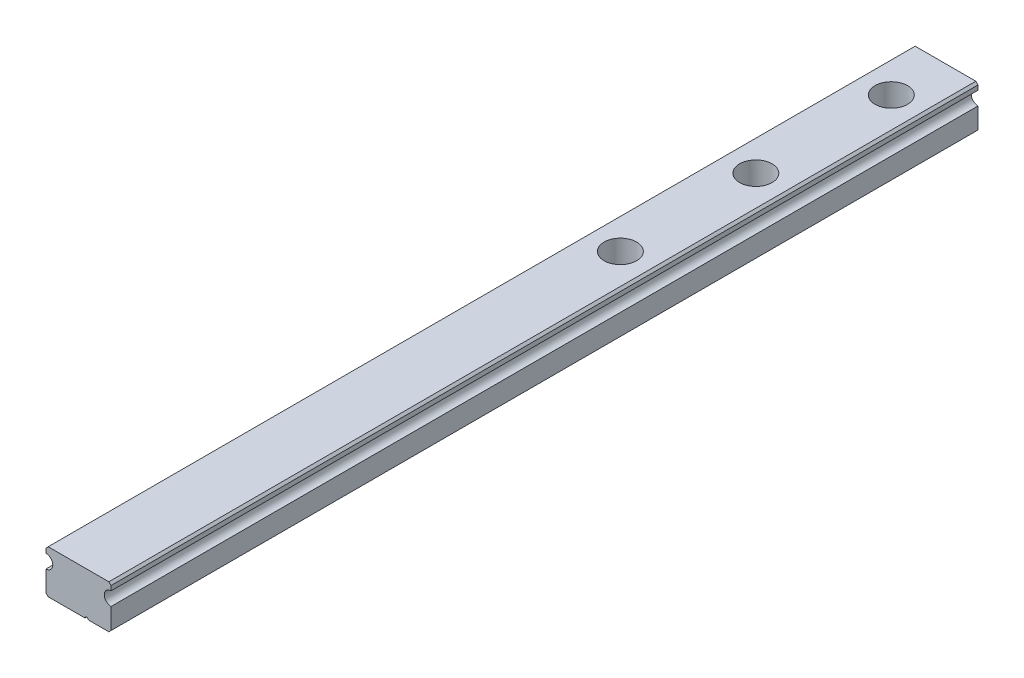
ISO-10303-21;
HEADER;
FILE_DESCRIPTION(('STEP AP214'),'2;1');
FILE_NAME('part.step','',(''),(''),'','','');
FILE_SCHEMA(('AUTOMOTIVE_DESIGN { 1 0 10303 214 1 1 1 1 }'));
ENDSEC;
DATA;
#1=APPLICATION_CONTEXT('core data for automotive mechanical design processes');
#2=APPLICATION_PROTOCOL_DEFINITION('international standard','automotive_design',2000,#1);
#3=PRODUCT_CONTEXT('',#1,'mechanical');
#4=PRODUCT('Part','Part','',(#3));
#5=PRODUCT_RELATED_PRODUCT_CATEGORY('part','',(#4));
#6=PRODUCT_DEFINITION_FORMATION('','',#4);
#7=PRODUCT_DEFINITION_CONTEXT('part definition',#1,'design');
#8=PRODUCT_DEFINITION('design','',#6,#7);
#9=PRODUCT_DEFINITION_SHAPE('','',#8);
#10=(LENGTH_UNIT() NAMED_UNIT(*) SI_UNIT(.MILLI.,.METRE.));
#11=(NAMED_UNIT(*) PLANE_ANGLE_UNIT() SI_UNIT($,.RADIAN.));
#12=(NAMED_UNIT(*) SI_UNIT($,.STERADIAN.) SOLID_ANGLE_UNIT());
#13=UNCERTAINTY_MEASURE_WITH_UNIT(LENGTH_MEASURE(1.E-05),#10,'distance_accuracy_value','');
#14=(GEOMETRIC_REPRESENTATION_CONTEXT(3) GLOBAL_UNCERTAINTY_ASSIGNED_CONTEXT((#13)) GLOBAL_UNIT_ASSIGNED_CONTEXT((#10,
#11,#12)) REPRESENTATION_CONTEXT('',''));
#15=CARTESIAN_POINT('',(0.,0.,0.));
#16=DIRECTION('',(0.,0.,1.));
#17=DIRECTION('',(1.,0.,0.));
#18=AXIS2_PLACEMENT_3D('',#15,#16,#17);
#19=CARTESIAN_POINT('',(6.,0.4,125.));
#20=DIRECTION('',(0.707106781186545,-0.70710678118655,0.));
#21=DIRECTION('',(0.70710678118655,0.707106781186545,0.));
#22=AXIS2_PLACEMENT_3D('',#19,#20,#21);
#23=PLANE('',#22);
#24=DIRECTION('',(0.70710678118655,0.707106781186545,0.));
#25=VECTOR('',#24,1.);
#26=CARTESIAN_POINT('',(6.,0.4,125.));
#27=LINE('',#26,#25);
#28=CARTESIAN_POINT('',(6.,0.4,125.));
#29=VERTEX_POINT('',#28);
#30=CARTESIAN_POINT('',(5.6,0.,125.));
#31=VERTEX_POINT('',#30);
#32=EDGE_CURVE('E236',#29,#31,#27,.F.);
#33=ORIENTED_EDGE('',*,*,#32,.T.);
#34=DIRECTION('',(0.,0.,1.));
#35=VECTOR('',#34,1.);
#36=CARTESIAN_POINT('',(5.6,0.,125.));
#37=LINE('',#36,#35);
#38=CARTESIAN_POINT('',(5.6,0.,-35.));
#39=VERTEX_POINT('',#38);
#40=EDGE_CURVE('E149',#39,#31,#37,.T.);
#41=ORIENTED_EDGE('',*,*,#40,.F.);
#42=DIRECTION('',(0.70710678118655,0.707106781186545,0.));
#43=VECTOR('',#42,1.);
#44=CARTESIAN_POINT('',(6.,0.4,-35.));
#45=LINE('',#44,#43);
#46=CARTESIAN_POINT('',(6.,0.4,-35.));
#47=VERTEX_POINT('',#46);
#48=EDGE_CURVE('E239',#39,#47,#45,.T.);
#49=ORIENTED_EDGE('',*,*,#48,.T.);
#50=DIRECTION('',(0.,0.,-1.));
#51=VECTOR('',#50,1.);
#52=CARTESIAN_POINT('',(6.,0.4,125.));
#53=LINE('',#52,#51);
#54=EDGE_CURVE('E177',#29,#47,#53,.T.);
#55=ORIENTED_EDGE('',*,*,#54,.F.);
#56=EDGE_LOOP('',(#33,#41,#49,#55));
#57=FACE_BOUND('',#56,.T.);
#58=ADVANCED_FACE('F17',(#57),#23,.T.);
#59=CARTESIAN_POINT('',(0.,8.,-25.));
#60=DIRECTION('',(0.,1.,0.));
#61=DIRECTION('',(0.,0.,1.));
#62=AXIS2_PLACEMENT_3D('',#59,#60,#61);
#63=CYLINDRICAL_SURFACE('',#62,1.75000000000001);
#64=CARTESIAN_POINT('',(0.,3.5,-25.));
#65=DIRECTION('',(0.,1.,0.));
#66=DIRECTION('',(0.,0.,1.));
#67=AXIS2_PLACEMENT_3D('',#64,#65,#66);
#68=CIRCLE('',#67,1.75000000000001);
#69=CARTESIAN_POINT('',(0.,3.5,-23.25));
#70=VERTEX_POINT('',#69);
#71=EDGE_CURVE('E154',#70,#70,#68,.T.);
#72=ORIENTED_EDGE('',*,*,#71,.T.);
#73=EDGE_LOOP('',(#72));
#74=FACE_BOUND('',#73,.T.);
#75=CARTESIAN_POINT('',(0.,0.,-25.));
#76=DIRECTION('',(0.,1.,0.));
#77=DIRECTION('',(0.,0.,1.));
#78=AXIS2_PLACEMENT_3D('',#75,#76,#77);
#79=CIRCLE('',#78,1.75000000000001);
#80=CARTESIAN_POINT('',(1.20000000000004,0.,-26.2737739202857));
#81=VERTEX_POINT('',#80);
#82=CARTESIAN_POINT('',(1.20000000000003,0.,-23.7262260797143));
#83=VERTEX_POINT('',#82);
#84=EDGE_CURVE('E138',#81,#83,#79,.T.);
#85=ORIENTED_EDGE('',*,*,#84,.F.);
#86=CARTESIAN_POINT('',(1.20000000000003,0.,-26.2737739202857));
#87=CARTESIAN_POINT('',(1.19997772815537,0.0134143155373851,-26.2737884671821));
#88=CARTESIAN_POINT('',(1.20089826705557,0.0268050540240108,-26.2729277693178));
#89=CARTESIAN_POINT('',(1.20444093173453,0.0530610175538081,-26.2695795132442));
#90=CARTESIAN_POINT('',(1.20705151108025,0.0659291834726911,-26.2671029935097));
#91=CARTESIAN_POINT('',(1.21378899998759,0.0908326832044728,-26.2606492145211));
#92=CARTESIAN_POINT('',(1.21791337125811,0.102869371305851,-26.2566744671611));
#93=CARTESIAN_POINT('',(1.22741265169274,0.125902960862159,-26.2473983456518));
#94=CARTESIAN_POINT('',(1.23278953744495,0.13689817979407,-26.2420948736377));
#95=CARTESIAN_POINT('',(1.24639319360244,0.161034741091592,-26.2284636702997));
#96=CARTESIAN_POINT('',(1.25498082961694,0.173732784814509,-26.2197115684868));
#97=CARTESIAN_POINT('',(1.27324228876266,0.196978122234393,-26.2006371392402));
#98=CARTESIAN_POINT('',(1.28291785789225,0.207521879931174,-26.1903122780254));
#99=CARTESIAN_POINT('',(1.30691151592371,0.230418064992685,-26.1640066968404));
#100=CARTESIAN_POINT('',(1.32152259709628,0.24177315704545,-26.1474290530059));
#101=CARTESIAN_POINT('',(1.35099650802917,0.260975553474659,-26.1125801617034));
#102=CARTESIAN_POINT('',(1.36585974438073,0.26881649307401,-26.0943059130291));
#103=CARTESIAN_POINT('',(1.40380634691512,0.285290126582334,-26.0455857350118));
#104=CARTESIAN_POINT('',(1.42665558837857,0.291742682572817,-26.0142294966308));
#105=CARTESIAN_POINT('',(1.47044316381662,0.299367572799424,-25.949649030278));
#106=CARTESIAN_POINT('',(1.49137784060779,0.300530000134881,-25.9164214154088));
#107=CARTESIAN_POINT('',(1.52853104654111,0.299144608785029,-25.8528079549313));
#108=CARTESIAN_POINT('',(1.54501387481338,0.297027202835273,-25.8225624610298));
#109=CARTESIAN_POINT('',(1.57608987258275,0.290623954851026,-25.7613287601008));
#110=CARTESIAN_POINT('',(1.59068151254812,0.286336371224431,-25.7303399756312));
#111=CARTESIAN_POINT('',(1.63169323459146,0.271125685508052,-25.6362200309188));
#112=CARTESIAN_POINT('',(1.65520534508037,0.257871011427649,-25.5721845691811));
#113=CARTESIAN_POINT('',(1.6858654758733,0.235874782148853,-25.4709540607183));
#114=CARTESIAN_POINT('',(1.69565753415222,0.22772050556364,-25.4343751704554));
#115=CARTESIAN_POINT('',(1.71287327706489,0.21171387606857,-25.3605573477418));
#116=CARTESIAN_POINT('',(1.72029538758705,0.20386172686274,-25.3233179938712));
#117=CARTESIAN_POINT('',(1.73266651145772,0.189617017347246,-25.2485686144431));
#118=CARTESIAN_POINT('',(1.73764123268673,0.183209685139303,-25.2110657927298));
#119=CARTESIAN_POINT('',(1.74515907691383,0.173025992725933,-25.1354915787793));
#120=CARTESIAN_POINT('',(1.7477058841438,0.169245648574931,-25.09742113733));
#121=CARTESIAN_POINT('',(1.75043937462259,0.165197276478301,-25.0165879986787));
#122=CARTESIAN_POINT('',(1.75032130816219,0.165382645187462,-24.9737886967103));
#123=CARTESIAN_POINT('',(1.74697040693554,0.170326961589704,-24.8885498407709));
#124=CARTESIAN_POINT('',(1.74373279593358,0.17509292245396,-24.8461109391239));
#125=CARTESIAN_POINT('',(1.73420974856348,0.187634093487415,-24.761567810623));
#126=CARTESIAN_POINT('',(1.72788959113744,0.195443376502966,-24.7194730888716));
#127=CARTESIAN_POINT('',(1.71227570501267,0.212299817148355,-24.6361180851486));
#128=CARTESIAN_POINT('',(1.70298262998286,0.221346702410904,-24.5948576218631));
#129=CARTESIAN_POINT('',(1.68312021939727,0.237923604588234,-24.5195057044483));
#130=CARTESIAN_POINT('',(1.67297983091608,0.245468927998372,-24.4853050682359));
#131=CARTESIAN_POINT('',(1.65058287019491,0.259810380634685,-24.4174570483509));
#132=CARTESIAN_POINT('',(1.6383260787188,0.266606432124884,-24.383809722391));
#133=CARTESIAN_POINT('',(1.59851782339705,0.284862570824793,-24.2842484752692));
#134=CARTESIAN_POINT('',(1.56776912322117,0.294346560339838,-24.2191057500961));
#135=CARTESIAN_POINT('',(1.51906061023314,0.299716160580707,-24.130637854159));
#136=CARTESIAN_POINT('',(1.50451070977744,0.300347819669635,-24.1056942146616));
#137=CARTESIAN_POINT('',(1.47418237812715,0.299273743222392,-24.0565388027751));
#138=CARTESIAN_POINT('',(1.45840211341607,0.297564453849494,-24.0323282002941));
#139=CARTESIAN_POINT('',(1.42573869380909,0.291143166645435,-23.984812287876));
#140=CARTESIAN_POINT('',(1.40884891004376,0.286411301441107,-23.961514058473));
#141=CARTESIAN_POINT('',(1.37450268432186,0.273109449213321,-23.9164694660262));
#142=CARTESIAN_POINT('',(1.35704733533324,0.264546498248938,-23.894720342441));
#143=CARTESIAN_POINT('',(1.32807090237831,0.246232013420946,-23.8602373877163));
#144=CARTESIAN_POINT('',(1.31647409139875,0.237782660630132,-23.8468795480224));
#145=CARTESIAN_POINT('',(1.29382468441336,0.218433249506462,-23.8215243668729));
#146=CARTESIAN_POINT('',(1.28277160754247,0.207535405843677,-23.8095258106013));
#147=CARTESIAN_POINT('',(1.26369175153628,0.185291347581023,-23.789322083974));
#148=CARTESIAN_POINT('',(1.25547772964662,0.174376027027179,-23.7808225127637));
#149=CARTESIAN_POINT('',(1.24025535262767,0.150762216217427,-23.7653404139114));
#150=CARTESIAN_POINT('',(1.23324568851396,0.138065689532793,-23.7583562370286));
#151=CARTESIAN_POINT('',(1.2219714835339,0.113366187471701,-23.7472679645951));
#152=CARTESIAN_POINT('',(1.21744272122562,0.101613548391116,-23.7428759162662));
#153=CARTESIAN_POINT('',(1.20982990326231,0.0772253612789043,-23.7355476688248));
#154=CARTESIAN_POINT('',(1.2067435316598,0.0645912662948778,-23.7326091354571));
#155=CARTESIAN_POINT('',(1.20300774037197,0.0432360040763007,-23.7290646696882));
#156=CARTESIAN_POINT('',(1.20188491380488,0.0346688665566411,-23.7280037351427));
#157=CARTESIAN_POINT('',(1.20037894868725,0.0174033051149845,-23.7265830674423));
#158=CARTESIAN_POINT('',(1.19999661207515,0.00870474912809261,-23.7262240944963));
#159=CARTESIAN_POINT('',(1.20000000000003,0.,-23.7262260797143));
#160=B_SPLINE_CURVE_WITH_KNOTS('',3,(#86,#87,#88,#89,#90,#91,#92,#93,#94,#95,#96,#97,#98,#99,
#100,#101,#102,#103,#104,#105,#106,#107,#108,#109,#110,#111,#112,#113,#114,#115,#116,#117,#118,
#119,#120,#121,#122,#123,#124,#125,#126,#127,#128,#129,#130,#131,#132,#133,#134,#135,#136,#137,
#138,#139,#140,#141,#142,#143,#144,#145,#146,#147,#148,#149,#150,#151,#152,#153,#154,#155,#156,
#157,#158,#159),.UNSPECIFIED.,.F.,.F.,(4,2,2,2,2,2,2,2,2,2,2,2,2,2,2,2,2,2,2,2,2,2,2,2,2,2,2,2,
2,2,2,2,2,2,2,2,4),(0.,0.0401465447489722,0.0800216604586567,0.119830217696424,
0.159702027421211,0.212366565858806,0.265116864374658,0.3392342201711,0.413485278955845,
0.530816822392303,0.648368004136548,0.751747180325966,0.855209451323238,1.06299110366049,
1.17914736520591,1.29538061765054,1.41036537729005,1.52517537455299,1.65317503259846,
1.78137097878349,1.9110454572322,2.04069144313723,2.14999818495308,2.25931625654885,
2.47601721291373,2.56257443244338,2.64926320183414,2.7365277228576,2.8236326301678,
2.88228135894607,2.9408772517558,2.98896485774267,3.0369998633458,3.07685156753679,
3.11663906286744,3.1426980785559,3.16878529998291),.UNSPECIFIED.);
#161=EDGE_CURVE('E151',#81,#83,#160,.T.);
#162=ORIENTED_EDGE('',*,*,#161,.T.);
#163=EDGE_LOOP('',(#85,#162));
#164=FACE_BOUND('',#163,.T.);
#165=ADVANCED_FACE('F152',(#74,#164),#63,.F.);
#166=CARTESIAN_POINT('',(0.,8.,0.));
#167=DIRECTION('',(0.,1.,0.));
#168=DIRECTION('',(0.,0.,1.));
#169=AXIS2_PLACEMENT_3D('',#166,#167,#168);
#170=CYLINDRICAL_SURFACE('',#169,1.75000000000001);
#171=CARTESIAN_POINT('',(0.,3.5,0.));
#172=DIRECTION('',(0.,1.,0.));
#173=DIRECTION('',(0.,0.,1.));
#174=AXIS2_PLACEMENT_3D('',#171,#172,#173);
#175=CIRCLE('',#174,1.75000000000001);
#176=CARTESIAN_POINT('',(0.,3.5,1.75000000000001));
#177=VERTEX_POINT('',#176);
#178=EDGE_CURVE('E292',#177,#177,#175,.T.);
#179=ORIENTED_EDGE('',*,*,#178,.T.);
#180=EDGE_LOOP('',(#179));
#181=FACE_BOUND('',#180,.T.);
#182=CARTESIAN_POINT('',(0.,0.,0.));
#183=DIRECTION('',(0.,1.,0.));
#184=DIRECTION('',(0.,0.,1.));
#185=AXIS2_PLACEMENT_3D('',#182,#183,#184);
#186=CIRCLE('',#185,1.75000000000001);
#187=CARTESIAN_POINT('',(1.20000000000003,0.,-1.27377392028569));
#188=VERTEX_POINT('',#187);
#189=CARTESIAN_POINT('',(1.20000000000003,0.,1.27377392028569));
#190=VERTEX_POINT('',#189);
#191=EDGE_CURVE('E161',#188,#190,#186,.T.);
#192=ORIENTED_EDGE('',*,*,#191,.F.);
#193=CARTESIAN_POINT('',(1.20000000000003,0.,-1.27377392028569));
#194=CARTESIAN_POINT('',(1.19997772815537,0.0134143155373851,-1.27378846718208));
#195=CARTESIAN_POINT('',(1.20089826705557,0.026805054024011,-1.27292776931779));
#196=CARTESIAN_POINT('',(1.20444093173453,0.0530610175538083,-1.26957951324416));
#197=CARTESIAN_POINT('',(1.20705151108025,0.0659291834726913,-1.26710299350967));
#198=CARTESIAN_POINT('',(1.21378899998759,0.0908326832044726,-1.26064921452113));
#199=CARTESIAN_POINT('',(1.21791337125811,0.10286937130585,-1.25667446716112));
#200=CARTESIAN_POINT('',(1.22741265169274,0.125902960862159,-1.24739834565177));
#201=CARTESIAN_POINT('',(1.23278953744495,0.13689817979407,-1.24209487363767));
#202=CARTESIAN_POINT('',(1.24639319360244,0.161034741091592,-1.22846367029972));
#203=CARTESIAN_POINT('',(1.25498082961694,0.173732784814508,-1.21971156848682));
#204=CARTESIAN_POINT('',(1.27324228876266,0.196978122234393,-1.20063713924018));
#205=CARTESIAN_POINT('',(1.28291785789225,0.207521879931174,-1.19031227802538));
#206=CARTESIAN_POINT('',(1.30691151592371,0.230418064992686,-1.1640066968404));
#207=CARTESIAN_POINT('',(1.32152259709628,0.24177315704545,-1.1474290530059));
#208=CARTESIAN_POINT('',(1.35099650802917,0.260975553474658,-1.11258016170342));
#209=CARTESIAN_POINT('',(1.36585974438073,0.26881649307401,-1.09430591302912));
#210=CARTESIAN_POINT('',(1.40380634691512,0.285290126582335,-1.0455857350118));
#211=CARTESIAN_POINT('',(1.42665558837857,0.291742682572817,-1.01422949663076));
#212=CARTESIAN_POINT('',(1.47044316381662,0.299367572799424,-0.949649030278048));
#213=CARTESIAN_POINT('',(1.49137784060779,0.300530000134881,-0.916421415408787));
#214=CARTESIAN_POINT('',(1.52853104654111,0.299144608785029,-0.852807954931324));
#215=CARTESIAN_POINT('',(1.54501387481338,0.297027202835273,-0.822562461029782));
#216=CARTESIAN_POINT('',(1.57608987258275,0.290623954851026,-0.761328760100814));
#217=CARTESIAN_POINT('',(1.59068151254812,0.286336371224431,-0.730339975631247));
#218=CARTESIAN_POINT('',(1.63169323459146,0.271125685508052,-0.63622003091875));
#219=CARTESIAN_POINT('',(1.65520534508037,0.257871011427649,-0.572184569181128));
#220=CARTESIAN_POINT('',(1.6858654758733,0.235874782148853,-0.470954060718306));
#221=CARTESIAN_POINT('',(1.69565753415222,0.22772050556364,-0.434375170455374));
#222=CARTESIAN_POINT('',(1.71287327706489,0.21171387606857,-0.360557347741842));
#223=CARTESIAN_POINT('',(1.72029538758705,0.203861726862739,-0.323317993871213));
#224=CARTESIAN_POINT('',(1.73266651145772,0.189617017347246,-0.248568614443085));
#225=CARTESIAN_POINT('',(1.73764123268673,0.183209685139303,-0.211065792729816));
#226=CARTESIAN_POINT('',(1.74515907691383,0.173025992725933,-0.135491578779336));
#227=CARTESIAN_POINT('',(1.7477058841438,0.169245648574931,-0.0974211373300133));
#228=CARTESIAN_POINT('',(1.75043937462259,0.165197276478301,-0.0165879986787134));
#229=CARTESIAN_POINT('',(1.75032130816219,0.165382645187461,0.0262113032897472));
#230=CARTESIAN_POINT('',(1.74697040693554,0.170326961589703,0.111450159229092));
#231=CARTESIAN_POINT('',(1.74373279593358,0.17509292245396,0.153889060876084));
#232=CARTESIAN_POINT('',(1.73420974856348,0.187634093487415,0.238432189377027));
#233=CARTESIAN_POINT('',(1.72788959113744,0.195443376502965,0.280526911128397));
#234=CARTESIAN_POINT('',(1.71227570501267,0.212299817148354,0.363881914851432));
#235=CARTESIAN_POINT('',(1.70298262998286,0.221346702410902,0.405142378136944));
#236=CARTESIAN_POINT('',(1.68312021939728,0.237923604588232,0.480494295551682));
#237=CARTESIAN_POINT('',(1.67297983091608,0.245468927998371,0.514694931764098));
#238=CARTESIAN_POINT('',(1.65058287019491,0.259810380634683,0.582542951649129));
#239=CARTESIAN_POINT('',(1.6383260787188,0.266606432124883,0.616190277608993));
#240=CARTESIAN_POINT('',(1.59851782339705,0.284862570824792,0.715751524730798));
#241=CARTESIAN_POINT('',(1.56776912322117,0.294346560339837,0.780894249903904));
#242=CARTESIAN_POINT('',(1.51906061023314,0.299716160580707,0.869362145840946));
#243=CARTESIAN_POINT('',(1.50451070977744,0.300347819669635,0.894305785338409));
#244=CARTESIAN_POINT('',(1.47418237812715,0.299273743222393,0.943461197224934));
#245=CARTESIAN_POINT('',(1.45840211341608,0.297564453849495,0.96767179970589));
#246=CARTESIAN_POINT('',(1.42573869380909,0.291143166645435,1.01518771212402));
#247=CARTESIAN_POINT('',(1.40884891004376,0.286411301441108,1.03848594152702));
#248=CARTESIAN_POINT('',(1.37450268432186,0.273109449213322,1.08353053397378));
#249=CARTESIAN_POINT('',(1.35704733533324,0.264546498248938,1.10527965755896));
#250=CARTESIAN_POINT('',(1.32807090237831,0.246232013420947,1.13976261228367));
#251=CARTESIAN_POINT('',(1.31647409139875,0.237782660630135,1.15312045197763));
#252=CARTESIAN_POINT('',(1.29382468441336,0.218433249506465,1.17847563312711));
#253=CARTESIAN_POINT('',(1.28277160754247,0.207535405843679,1.19047418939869));
#254=CARTESIAN_POINT('',(1.26369175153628,0.185291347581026,1.21067791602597));
#255=CARTESIAN_POINT('',(1.25547772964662,0.174376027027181,1.21917748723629));
#256=CARTESIAN_POINT('',(1.24025535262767,0.150762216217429,1.23465958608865));
#257=CARTESIAN_POINT('',(1.23324568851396,0.138065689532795,1.24164376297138));
#258=CARTESIAN_POINT('',(1.2219714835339,0.113366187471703,1.25273203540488));
#259=CARTESIAN_POINT('',(1.21744272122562,0.101613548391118,1.2571240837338));
#260=CARTESIAN_POINT('',(1.20982990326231,0.0772253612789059,1.2644523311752));
#261=CARTESIAN_POINT('',(1.2067435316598,0.0645912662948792,1.26739086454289));
#262=CARTESIAN_POINT('',(1.20300774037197,0.0432360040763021,1.27093533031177));
#263=CARTESIAN_POINT('',(1.20188491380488,0.0346688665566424,1.27199626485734));
#264=CARTESIAN_POINT('',(1.20037894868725,0.0174033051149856,1.2734169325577));
#265=CARTESIAN_POINT('',(1.19999661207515,0.00870474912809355,1.27377590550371));
#266=CARTESIAN_POINT('',(1.20000000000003,0.,1.27377392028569));
#267=B_SPLINE_CURVE_WITH_KNOTS('',3,(#193,#194,#195,#196,#197,#198,#199,#200,#201,#202,#203,
#204,#205,#206,#207,#208,#209,#210,#211,#212,#213,#214,#215,#216,#217,#218,#219,#220,#221,#222,
#223,#224,#225,#226,#227,#228,#229,#230,#231,#232,#233,#234,#235,#236,#237,#238,#239,#240,#241,
#242,#243,#244,#245,#246,#247,#248,#249,#250,#251,#252,#253,#254,#255,#256,#257,#258,#259,#260,
#261,#262,#263,#264,#265,#266),.UNSPECIFIED.,.F.,.F.,(4,2,2,2,2,2,2,2,2,2,2,2,2,2,2,2,2,2,2,2,2,
2,2,2,2,2,2,2,2,2,2,2,2,2,2,2,4),(0.,0.0401465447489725,0.0800216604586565,0.119830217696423,
0.15970202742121,0.212366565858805,0.265116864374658,0.339234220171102,0.413485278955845,
0.530816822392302,0.64836800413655,0.751747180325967,0.855209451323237,1.06299110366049,
1.1791473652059,1.29538061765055,1.41036537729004,1.52517537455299,1.65317503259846,
1.7813709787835,1.9110454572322,2.04069144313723,2.14999818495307,2.25931625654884,
2.47601721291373,2.56257443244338,2.64926320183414,2.7365277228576,2.8236326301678,
2.88228135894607,2.9408772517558,2.98896485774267,3.0369998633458,3.07685156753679,
3.11663906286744,3.1426980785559,3.16878529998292),.UNSPECIFIED.);
#268=EDGE_CURVE('E20',#188,#190,#267,.T.);
#269=ORIENTED_EDGE('',*,*,#268,.T.);
#270=EDGE_LOOP('',(#192,#269));
#271=FACE_BOUND('',#270,.T.);
#272=ADVANCED_FACE('F321',(#181,#271),#170,.F.);
#273=CARTESIAN_POINT('',(0.,8.,25.));
#274=DIRECTION('',(0.,1.,0.));
#275=DIRECTION('',(0.,0.,1.));
#276=AXIS2_PLACEMENT_3D('',#273,#274,#275);
#277=CYLINDRICAL_SURFACE('',#276,1.75000000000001);
#278=CARTESIAN_POINT('',(0.,3.5,25.));
#279=DIRECTION('',(0.,1.,0.));
#280=DIRECTION('',(0.,0.,1.));
#281=AXIS2_PLACEMENT_3D('',#278,#279,#280);
#282=CIRCLE('',#281,1.75000000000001);
#283=CARTESIAN_POINT('',(0.,3.5,26.75));
#284=VERTEX_POINT('',#283);
#285=EDGE_CURVE('E247',#284,#284,#282,.T.);
#286=ORIENTED_EDGE('',*,*,#285,.T.);
#287=EDGE_LOOP('',(#286));
#288=FACE_BOUND('',#287,.T.);
#289=CARTESIAN_POINT('',(0.,0.,25.));
#290=DIRECTION('',(0.,1.,0.));
#291=DIRECTION('',(0.,0.,1.));
#292=AXIS2_PLACEMENT_3D('',#289,#290,#291);
#293=CIRCLE('',#292,1.75000000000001);
#294=CARTESIAN_POINT('',(1.20000000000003,0.,23.7262260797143));
#295=VERTEX_POINT('',#294);
#296=CARTESIAN_POINT('',(1.20000000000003,0.,26.2737739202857));
#297=VERTEX_POINT('',#296);
#298=EDGE_CURVE('E288',#295,#297,#293,.T.);
#299=ORIENTED_EDGE('',*,*,#298,.F.);
#300=CARTESIAN_POINT('',(1.20000000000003,0.,23.7262260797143));
#301=CARTESIAN_POINT('',(1.19997772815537,0.0134143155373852,23.7262115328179));
#302=CARTESIAN_POINT('',(1.20089826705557,0.0268050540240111,23.7270722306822));
#303=CARTESIAN_POINT('',(1.20444093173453,0.0530610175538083,23.7304204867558));
#304=CARTESIAN_POINT('',(1.20705151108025,0.0659291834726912,23.7328970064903));
#305=CARTESIAN_POINT('',(1.21378899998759,0.0908326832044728,23.7393507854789));
#306=CARTESIAN_POINT('',(1.21791337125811,0.102869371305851,23.7433255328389));
#307=CARTESIAN_POINT('',(1.22741265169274,0.125902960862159,23.7526016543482));
#308=CARTESIAN_POINT('',(1.23278953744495,0.13689817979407,23.7579051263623));
#309=CARTESIAN_POINT('',(1.24639319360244,0.161034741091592,23.7715363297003));
#310=CARTESIAN_POINT('',(1.25498082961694,0.173732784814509,23.7802884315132));
#311=CARTESIAN_POINT('',(1.27324228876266,0.196978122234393,23.7993628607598));
#312=CARTESIAN_POINT('',(1.28291785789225,0.207521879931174,23.8096877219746));
#313=CARTESIAN_POINT('',(1.30691151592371,0.230418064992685,23.8359933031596));
#314=CARTESIAN_POINT('',(1.32152259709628,0.24177315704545,23.8525709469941));
#315=CARTESIAN_POINT('',(1.35099650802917,0.260975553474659,23.8874198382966));
#316=CARTESIAN_POINT('',(1.36585974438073,0.26881649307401,23.9056940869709));
#317=CARTESIAN_POINT('',(1.40380634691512,0.285290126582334,23.9544142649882));
#318=CARTESIAN_POINT('',(1.42665558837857,0.291742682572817,23.9857705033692));
#319=CARTESIAN_POINT('',(1.47044316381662,0.299367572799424,24.050350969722));
#320=CARTESIAN_POINT('',(1.49137784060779,0.300530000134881,24.0835785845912));
#321=CARTESIAN_POINT('',(1.52853104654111,0.299144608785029,24.1471920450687));
#322=CARTESIAN_POINT('',(1.54501387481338,0.297027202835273,24.1774375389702));
#323=CARTESIAN_POINT('',(1.57608987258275,0.290623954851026,24.2386712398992));
#324=CARTESIAN_POINT('',(1.59068151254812,0.286336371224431,24.2696600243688));
#325=CARTESIAN_POINT('',(1.63169323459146,0.271125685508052,24.3637799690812));
#326=CARTESIAN_POINT('',(1.65520534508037,0.257871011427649,24.4278154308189));
#327=CARTESIAN_POINT('',(1.68586547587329,0.235874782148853,24.5290459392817));
#328=CARTESIAN_POINT('',(1.69565753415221,0.227720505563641,24.5656248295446));
#329=CARTESIAN_POINT('',(1.71287327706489,0.211713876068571,24.6394426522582));
#330=CARTESIAN_POINT('',(1.72029538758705,0.20386172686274,24.6766820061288));
#331=CARTESIAN_POINT('',(1.73266651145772,0.189617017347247,24.7514313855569));
#332=CARTESIAN_POINT('',(1.73764123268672,0.183209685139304,24.7889342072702));
#333=CARTESIAN_POINT('',(1.74515907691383,0.173025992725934,24.8645084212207));
#334=CARTESIAN_POINT('',(1.7477058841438,0.169245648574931,24.90257886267));
#335=CARTESIAN_POINT('',(1.75043937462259,0.165197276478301,24.9834120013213));
#336=CARTESIAN_POINT('',(1.75032130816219,0.165382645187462,25.0262113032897));
#337=CARTESIAN_POINT('',(1.74697040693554,0.170326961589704,25.1114501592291));
#338=CARTESIAN_POINT('',(1.74373279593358,0.17509292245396,25.1538890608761));
#339=CARTESIAN_POINT('',(1.73420974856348,0.187634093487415,25.238432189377));
#340=CARTESIAN_POINT('',(1.72788959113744,0.195443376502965,25.2805269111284));
#341=CARTESIAN_POINT('',(1.71227570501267,0.212299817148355,25.3638819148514));
#342=CARTESIAN_POINT('',(1.70298262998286,0.221346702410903,25.4051423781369));
#343=CARTESIAN_POINT('',(1.68312021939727,0.237923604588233,25.4804942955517));
#344=CARTESIAN_POINT('',(1.67297983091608,0.245468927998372,25.5146949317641));
#345=CARTESIAN_POINT('',(1.65058287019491,0.259810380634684,25.5825429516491));
#346=CARTESIAN_POINT('',(1.6383260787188,0.266606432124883,25.616190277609));
#347=CARTESIAN_POINT('',(1.59851782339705,0.284862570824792,25.7157515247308));
#348=CARTESIAN_POINT('',(1.56776912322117,0.294346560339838,25.7808942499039));
#349=CARTESIAN_POINT('',(1.51906061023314,0.299716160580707,25.869362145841));
#350=CARTESIAN_POINT('',(1.50451070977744,0.300347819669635,25.8943057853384));
#351=CARTESIAN_POINT('',(1.47418237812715,0.299273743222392,25.9434611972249));
#352=CARTESIAN_POINT('',(1.45840211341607,0.297564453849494,25.9676717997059));
#353=CARTESIAN_POINT('',(1.42573869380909,0.291143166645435,26.015187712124));
#354=CARTESIAN_POINT('',(1.40884891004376,0.286411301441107,26.038485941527));
#355=CARTESIAN_POINT('',(1.37450268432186,0.273109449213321,26.0835305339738));
#356=CARTESIAN_POINT('',(1.35704733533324,0.264546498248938,26.105279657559));
#357=CARTESIAN_POINT('',(1.32807090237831,0.246232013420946,26.1397626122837));
#358=CARTESIAN_POINT('',(1.31647409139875,0.237782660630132,26.1531204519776));
#359=CARTESIAN_POINT('',(1.29382468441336,0.218433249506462,26.1784756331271));
#360=CARTESIAN_POINT('',(1.28277160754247,0.207535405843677,26.1904741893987));
#361=CARTESIAN_POINT('',(1.26369175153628,0.185291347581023,26.210677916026));
#362=CARTESIAN_POINT('',(1.25547772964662,0.174376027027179,26.2191774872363));
#363=CARTESIAN_POINT('',(1.24025535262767,0.150762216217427,26.2346595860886));
#364=CARTESIAN_POINT('',(1.23324568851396,0.138065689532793,26.2416437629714));
#365=CARTESIAN_POINT('',(1.2219714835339,0.113366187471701,26.2527320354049));
#366=CARTESIAN_POINT('',(1.21744272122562,0.101613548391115,26.2571240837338));
#367=CARTESIAN_POINT('',(1.20982990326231,0.0772253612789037,26.2644523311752));
#368=CARTESIAN_POINT('',(1.2067435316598,0.0645912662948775,26.2673908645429));
#369=CARTESIAN_POINT('',(1.20300774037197,0.0432360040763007,26.2709353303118));
#370=CARTESIAN_POINT('',(1.20188491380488,0.0346688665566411,26.2719962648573));
#371=CARTESIAN_POINT('',(1.20037894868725,0.0174033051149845,26.2734169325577));
#372=CARTESIAN_POINT('',(1.19999661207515,0.0087047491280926,26.2737759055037));
#373=CARTESIAN_POINT('',(1.20000000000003,0.,26.2737739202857));
#374=B_SPLINE_CURVE_WITH_KNOTS('',3,(#300,#301,#302,#303,#304,#305,#306,#307,#308,#309,#310,
#311,#312,#313,#314,#315,#316,#317,#318,#319,#320,#321,#322,#323,#324,#325,#326,#327,#328,#329,
#330,#331,#332,#333,#334,#335,#336,#337,#338,#339,#340,#341,#342,#343,#344,#345,#346,#347,#348,
#349,#350,#351,#352,#353,#354,#355,#356,#357,#358,#359,#360,#361,#362,#363,#364,#365,#366,#367,
#368,#369,#370,#371,#372,#373),.UNSPECIFIED.,.F.,.F.,(4,2,2,2,2,2,2,2,2,2,2,2,2,2,2,2,2,2,2,2,2,
2,2,2,2,2,2,2,2,2,2,2,2,2,2,2,4),(0.,0.0401465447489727,0.0800216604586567,0.119830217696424,
0.159702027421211,0.212366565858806,0.265116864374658,0.3392342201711,0.413485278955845,
0.530816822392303,0.648368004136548,0.751747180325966,0.855209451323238,1.06299110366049,
1.1791473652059,1.29538061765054,1.41036537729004,1.52517537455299,1.65317503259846,
1.78137097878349,1.9110454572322,2.04069144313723,2.14999818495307,2.25931625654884,
2.47601721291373,2.56257443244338,2.64926320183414,2.7365277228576,2.8236326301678,
2.88228135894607,2.9408772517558,2.98896485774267,3.0369998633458,3.07685156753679,
3.11663906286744,3.1426980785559,3.16878529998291),.UNSPECIFIED.);
#375=EDGE_CURVE('E312',#295,#297,#374,.T.);
#376=ORIENTED_EDGE('',*,*,#375,.T.);
#377=EDGE_LOOP('',(#299,#376));
#378=FACE_BOUND('',#377,.T.);
#379=ADVANCED_FACE('F318',(#288,#378),#277,.F.);
#380=CARTESIAN_POINT('',(-5.6,0.,125.));
#381=DIRECTION('',(-0.707106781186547,-0.707106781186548,0.));
#382=DIRECTION('',(0.707106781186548,-0.707106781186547,0.));
#383=AXIS2_PLACEMENT_3D('',#380,#381,#382);
#384=PLANE('',#383);
#385=DIRECTION('',(0.707106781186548,-0.707106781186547,0.));
#386=VECTOR('',#385,1.);
#387=CARTESIAN_POINT('',(-5.6,0.,125.));
#388=LINE('',#387,#386);
#389=CARTESIAN_POINT('',(-5.6,0.,125.));
#390=VERTEX_POINT('',#389);
#391=CARTESIAN_POINT('',(-6.,0.4,125.));
#392=VERTEX_POINT('',#391);
#393=EDGE_CURVE('E230',#390,#392,#388,.F.);
#394=ORIENTED_EDGE('',*,*,#393,.T.);
#395=DIRECTION('',(0.,0.,1.));
#396=VECTOR('',#395,1.);
#397=CARTESIAN_POINT('',(-6.,0.4,125.));
#398=LINE('',#397,#396);
#399=CARTESIAN_POINT('',(-6.,0.4,-34.9999999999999));
#400=VERTEX_POINT('',#399);
#401=EDGE_CURVE('E207',#400,#392,#398,.T.);
#402=ORIENTED_EDGE('',*,*,#401,.F.);
#403=DIRECTION('',(0.707106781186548,-0.707106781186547,0.));
#404=VECTOR('',#403,1.);
#405=CARTESIAN_POINT('',(-5.6,0.,-35.));
#406=LINE('',#405,#404);
#407=CARTESIAN_POINT('',(-5.6,0.,-35.));
#408=VERTEX_POINT('',#407);
#409=EDGE_CURVE('E232',#400,#408,#406,.T.);
#410=ORIENTED_EDGE('',*,*,#409,.T.);
#411=DIRECTION('',(0.,0.,1.));
#412=VECTOR('',#411,1.);
#413=CARTESIAN_POINT('',(-5.6,0.,125.));
#414=LINE('',#413,#412);
#415=EDGE_CURVE('E168',#390,#408,#414,.F.);
#416=ORIENTED_EDGE('',*,*,#415,.F.);
#417=EDGE_LOOP('',(#394,#402,#410,#416));
#418=FACE_BOUND('',#417,.T.);
#419=ADVANCED_FACE('F307',(#418),#384,.T.);
#420=CARTESIAN_POINT('',(1.5,0.,125.));
#421=DIRECTION('',(0.,0.,1.));
#422=DIRECTION('',(1.,0.,0.));
#423=AXIS2_PLACEMENT_3D('',#420,#421,#422);
#424=CYLINDRICAL_SURFACE('',#423,0.299999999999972);
#425=ORIENTED_EDGE('',*,*,#161,.F.);
#426=DIRECTION('',(0.,0.,1.));
#427=VECTOR('',#426,1.);
#428=CARTESIAN_POINT('',(1.20000000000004,0.,125.));
#429=LINE('',#428,#427);
#430=CARTESIAN_POINT('',(1.20000000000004,0.,-35.));
#431=VERTEX_POINT('',#430);
#432=EDGE_CURVE('E148',#431,#81,#429,.T.);
#433=ORIENTED_EDGE('',*,*,#432,.F.);
#434=CARTESIAN_POINT('',(1.5,0.,-35.));
#435=DIRECTION('',(0.,0.,1.));
#436=DIRECTION('',(1.,0.,0.));
#437=AXIS2_PLACEMENT_3D('',#434,#435,#436);
#438=CIRCLE('',#437,0.299999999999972);
#439=CARTESIAN_POINT('',(1.79999999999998,0.,-35.));
#440=VERTEX_POINT('',#439);
#441=EDGE_CURVE('E155',#440,#431,#438,.T.);
#442=ORIENTED_EDGE('',*,*,#441,.F.);
#443=DIRECTION('',(0.,0.,1.));
#444=VECTOR('',#443,1.);
#445=CARTESIAN_POINT('',(1.79999999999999,0.,125.));
#446=LINE('',#445,#444);
#447=CARTESIAN_POINT('',(1.79999999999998,0.,125.));
#448=VERTEX_POINT('',#447);
#449=EDGE_CURVE('E174',#448,#440,#446,.F.);
#450=ORIENTED_EDGE('',*,*,#449,.F.);
#451=CARTESIAN_POINT('',(1.5,0.,125.));
#452=DIRECTION('',(0.,0.,1.));
#453=DIRECTION('',(1.,0.,0.));
#454=AXIS2_PLACEMENT_3D('',#451,#452,#453);
#455=CIRCLE('',#454,0.299999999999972);
#456=CARTESIAN_POINT('',(1.20000000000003,0.,125.));
#457=VERTEX_POINT('',#456);
#458=EDGE_CURVE('E317',#457,#448,#455,.F.);
#459=ORIENTED_EDGE('',*,*,#458,.F.);
#460=DIRECTION('',(0.,0.,1.));
#461=VECTOR('',#460,1.);
#462=CARTESIAN_POINT('',(1.20000000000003,0.,125.));
#463=LINE('',#462,#461);
#464=EDGE_CURVE('E171',#297,#457,#463,.T.);
#465=ORIENTED_EDGE('',*,*,#464,.F.);
#466=ORIENTED_EDGE('',*,*,#375,.F.);
#467=DIRECTION('',(0.,0.,1.));
#468=VECTOR('',#467,1.);
#469=CARTESIAN_POINT('',(1.20000000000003,0.,125.));
#470=LINE('',#469,#468);
#471=EDGE_CURVE('E163',#190,#295,#470,.T.);
#472=ORIENTED_EDGE('',*,*,#471,.F.);
#473=ORIENTED_EDGE('',*,*,#268,.F.);
#474=DIRECTION('',(0.,0.,1.));
#475=VECTOR('',#474,1.);
#476=CARTESIAN_POINT('',(1.20000000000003,0.,125.));
#477=LINE('',#476,#475);
#478=EDGE_CURVE('E146',#83,#188,#477,.T.);
#479=ORIENTED_EDGE('',*,*,#478,.F.);
#480=EDGE_LOOP('',(#425,#433,#442,#450,#459,#465,#466,#472,#473,#479));
#481=FACE_BOUND('',#480,.T.);
#482=ADVANCED_FACE('F158',(#481),#424,.F.);
#483=CARTESIAN_POINT('',(1.75000000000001,3.5,-25.));
#484=DIRECTION('',(0.,-1.,0.));
#485=DIRECTION('',(0.,0.,-1.));
#486=AXIS2_PLACEMENT_3D('',#483,#484,#485);
#487=PLANE('',#486);
#488=CARTESIAN_POINT('',(0.,3.5,-25.));
#489=DIRECTION('',(0.,1.,0.));
#490=DIRECTION('',(0.,0.,1.));
#491=AXIS2_PLACEMENT_3D('',#488,#489,#490);
#492=CIRCLE('',#491,2.99999999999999);
#493=CARTESIAN_POINT('',(0.,3.5,-22.));
#494=VERTEX_POINT('',#493);
#495=EDGE_CURVE('E192',#494,#494,#492,.T.);
#496=ORIENTED_EDGE('',*,*,#495,.T.);
#497=EDGE_LOOP('',(#496));
#498=FACE_BOUND('',#497,.T.);
#499=ORIENTED_EDGE('',*,*,#71,.F.);
#500=EDGE_LOOP('',(#499));
#501=FACE_BOUND('',#500,.T.);
#502=ADVANCED_FACE('F306',(#498,#501),#487,.F.);
#503=CARTESIAN_POINT('',(1.75000000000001,3.5,0.));
#504=DIRECTION('',(0.,-1.,0.));
#505=DIRECTION('',(0.,0.,-1.));
#506=AXIS2_PLACEMENT_3D('',#503,#504,#505);
#507=PLANE('',#506);
#508=CARTESIAN_POINT('',(0.,3.5,0.));
#509=DIRECTION('',(0.,1.,0.));
#510=DIRECTION('',(0.,0.,1.));
#511=AXIS2_PLACEMENT_3D('',#508,#509,#510);
#512=CIRCLE('',#511,2.99999999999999);
#513=CARTESIAN_POINT('',(0.,3.5,2.99999999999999));
#514=VERTEX_POINT('',#513);
#515=EDGE_CURVE('E283',#514,#514,#512,.T.);
#516=ORIENTED_EDGE('',*,*,#515,.T.);
#517=EDGE_LOOP('',(#516));
#518=FACE_BOUND('',#517,.T.);
#519=ORIENTED_EDGE('',*,*,#178,.F.);
#520=EDGE_LOOP('',(#519));
#521=FACE_BOUND('',#520,.T.);
#522=ADVANCED_FACE('F400',(#518,#521),#507,.F.);
#523=CARTESIAN_POINT('',(1.75000000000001,3.5,25.));
#524=DIRECTION('',(0.,-1.,0.));
#525=DIRECTION('',(0.,0.,-1.));
#526=AXIS2_PLACEMENT_3D('',#523,#524,#525);
#527=PLANE('',#526);
#528=CARTESIAN_POINT('',(0.,3.5,25.));
#529=DIRECTION('',(0.,1.,0.));
#530=DIRECTION('',(0.,0.,1.));
#531=AXIS2_PLACEMENT_3D('',#528,#529,#530);
#532=CIRCLE('',#531,2.99999999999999);
#533=CARTESIAN_POINT('',(0.,3.5,28.));
#534=VERTEX_POINT('',#533);
#535=EDGE_CURVE('E279',#534,#534,#532,.T.);
#536=ORIENTED_EDGE('',*,*,#535,.T.);
#537=EDGE_LOOP('',(#536));
#538=FACE_BOUND('',#537,.T.);
#539=ORIENTED_EDGE('',*,*,#285,.F.);
#540=EDGE_LOOP('',(#539));
#541=FACE_BOUND('',#540,.T.);
#542=ADVANCED_FACE('F397',(#538,#541),#527,.F.);
#543=CARTESIAN_POINT('',(-6.,0.4,125.));
#544=DIRECTION('',(-1.,0.,0.));
#545=DIRECTION('',(0.,-1.,0.));
#546=AXIS2_PLACEMENT_3D('',#543,#544,#545);
#547=PLANE('',#546);
#548=DIRECTION('',(0.,0.,1.));
#549=VECTOR('',#548,1.);
#550=CARTESIAN_POINT('',(-6.,7.6,125.));
#551=LINE('',#550,#549);
#552=CARTESIAN_POINT('',(-6.,7.6,-35.));
#553=VERTEX_POINT('',#552);
#554=CARTESIAN_POINT('',(-6.,7.6,125.));
#555=VERTEX_POINT('',#554);
#556=EDGE_CURVE('E218',#553,#555,#551,.T.);
#557=ORIENTED_EDGE('',*,*,#556,.F.);
#558=DIRECTION('',(0.,1.,0.));
#559=VECTOR('',#558,1.);
#560=CARTESIAN_POINT('',(-6.,0.,-35.));
#561=LINE('',#560,#559);
#562=CARTESIAN_POINT('',(-5.99999999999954,6.74999999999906,-34.9999999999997));
#563=VERTEX_POINT('',#562);
#564=EDGE_CURVE('E277',#563,#553,#561,.T.);
#565=ORIENTED_EDGE('',*,*,#564,.F.);
#566=DIRECTION('',(0.,0.,-1.));
#567=VECTOR('',#566,1.);
#568=CARTESIAN_POINT('',(-5.99999999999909,6.74999999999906,-34.9999999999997));
#569=LINE('',#568,#567);
#570=CARTESIAN_POINT('',(-5.99999999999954,6.7499999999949,125.));
#571=VERTEX_POINT('',#570);
#572=EDGE_CURVE('E185',#563,#571,#569,.F.);
#573=ORIENTED_EDGE('',*,*,#572,.T.);
#574=DIRECTION('',(0.,-1.,0.));
#575=VECTOR('',#574,1.);
#576=CARTESIAN_POINT('',(-6.,0.4,125.));
#577=LINE('',#576,#575);
#578=EDGE_CURVE('E210',#571,#555,#577,.F.);
#579=ORIENTED_EDGE('',*,*,#578,.T.);
#580=EDGE_LOOP('',(#557,#565,#573,#579));
#581=FACE_BOUND('',#580,.T.);
#582=ADVANCED_FACE('F393',(#581),#547,.T.);
#583=CARTESIAN_POINT('',(-6.,0.4,125.));
#584=DIRECTION('',(-1.,0.,0.));
#585=DIRECTION('',(0.,-1.,0.));
#586=AXIS2_PLACEMENT_3D('',#583,#584,#585);
#587=PLANE('',#586);
#588=ORIENTED_EDGE('',*,*,#401,.T.);
#589=DIRECTION('',(0.,1.,0.));
#590=VECTOR('',#589,1.);
#591=CARTESIAN_POINT('',(-6.,0.,125.));
#592=LINE('',#591,#590);
#593=CARTESIAN_POINT('',(-6.,4.24999999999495,125.));
#594=VERTEX_POINT('',#593);
#595=EDGE_CURVE('E221',#392,#594,#592,.T.);
#596=ORIENTED_EDGE('',*,*,#595,.T.);
#597=DIRECTION('',(0.,0.,-1.));
#598=VECTOR('',#597,1.);
#599=CARTESIAN_POINT('',(-6.,4.24999999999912,-34.9999999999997));
#600=LINE('',#599,#598);
#601=CARTESIAN_POINT('',(-6.,4.24999999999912,-34.9999999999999));
#602=VERTEX_POINT('',#601);
#603=EDGE_CURVE('E205',#594,#602,#600,.T.);
#604=ORIENTED_EDGE('',*,*,#603,.T.);
#605=DIRECTION('',(0.,1.,0.));
#606=VECTOR('',#605,1.);
#607=CARTESIAN_POINT('',(-6.,0.,-35.));
#608=LINE('',#607,#606);
#609=EDGE_CURVE('E278',#400,#602,#608,.T.);
#610=ORIENTED_EDGE('',*,*,#609,.F.);
#611=EDGE_LOOP('',(#588,#596,#604,#610));
#612=FACE_BOUND('',#611,.T.);
#613=ADVANCED_FACE('F389',(#612),#587,.T.);
#614=CARTESIAN_POINT('',(-5.99999999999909,5.49999999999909,-34.9999999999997));
#615=DIRECTION('',(0.,0.,-1.));
#616=DIRECTION('',(0.,1.,0.));
#617=AXIS2_PLACEMENT_3D('',#614,#615,#616);
#618=CYLINDRICAL_SURFACE('',#617,1.24999999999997);
#619=CARTESIAN_POINT('',(-5.99999999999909,5.49999999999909,-34.9999999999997));
#620=DIRECTION('',(0.,0.,-1.));
#621=DIRECTION('',(0.,1.,0.));
#622=AXIS2_PLACEMENT_3D('',#619,#620,#621);
#623=CIRCLE('',#622,1.24999999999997);
#624=EDGE_CURVE('E274',#602,#563,#623,.F.);
#625=ORIENTED_EDGE('',*,*,#624,.F.);
#626=ORIENTED_EDGE('',*,*,#603,.F.);
#627=CARTESIAN_POINT('',(-5.99999999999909,5.49999999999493,125.));
#628=DIRECTION('',(0.,0.,-1.));
#629=DIRECTION('',(0.,1.,0.));
#630=AXIS2_PLACEMENT_3D('',#627,#628,#629);
#631=CIRCLE('',#630,1.24999999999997);
#632=EDGE_CURVE('E253',#594,#571,#631,.F.);
#633=ORIENTED_EDGE('',*,*,#632,.T.);
#634=ORIENTED_EDGE('',*,*,#572,.F.);
#635=EDGE_LOOP('',(#625,#626,#633,#634));
#636=FACE_BOUND('',#635,.T.);
#637=ADVANCED_FACE('F385',(#636),#618,.F.);
#638=CARTESIAN_POINT('',(6.00000000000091,5.49999999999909,-35.));
#639=DIRECTION('',(0.,0.,-1.));
#640=DIRECTION('',(0.,1.,0.));
#641=AXIS2_PLACEMENT_3D('',#638,#639,#640);
#642=CYLINDRICAL_SURFACE('',#641,1.24999999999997);
#643=CARTESIAN_POINT('',(6.00000000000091,5.49999999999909,-35.));
#644=DIRECTION('',(0.,0.,-1.));
#645=DIRECTION('',(0.,1.,0.));
#646=AXIS2_PLACEMENT_3D('',#643,#644,#645);
#647=CIRCLE('',#646,1.24999999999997);
#648=CARTESIAN_POINT('',(6.,6.74999999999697,-35.));
#649=VERTEX_POINT('',#648);
#650=CARTESIAN_POINT('',(6.,4.2499999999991,-35.));
#651=VERTEX_POINT('',#650);
#652=EDGE_CURVE('E270',#649,#651,#647,.F.);
#653=ORIENTED_EDGE('',*,*,#652,.F.);
#654=DIRECTION('',(0.,0.,-1.));
#655=VECTOR('',#654,1.);
#656=CARTESIAN_POINT('',(6.,6.74999999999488,125.));
#657=LINE('',#656,#655);
#658=CARTESIAN_POINT('',(6.,6.74999999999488,125.));
#659=VERTEX_POINT('',#658);
#660=EDGE_CURVE('E190',#659,#649,#657,.T.);
#661=ORIENTED_EDGE('',*,*,#660,.F.);
#662=CARTESIAN_POINT('',(6.00000000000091,5.49999999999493,125.));
#663=DIRECTION('',(0.,0.,-1.));
#664=DIRECTION('',(0.,1.,0.));
#665=AXIS2_PLACEMENT_3D('',#662,#663,#664);
#666=CIRCLE('',#665,1.24999999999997);
#667=CARTESIAN_POINT('',(6.,4.24999999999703,125.));
#668=VERTEX_POINT('',#667);
#669=EDGE_CURVE('E265',#659,#668,#666,.F.);
#670=ORIENTED_EDGE('',*,*,#669,.T.);
#671=DIRECTION('',(0.,0.,-1.));
#672=VECTOR('',#671,1.);
#673=CARTESIAN_POINT('',(6.,4.2499999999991,125.));
#674=LINE('',#673,#672);
#675=EDGE_CURVE('E182',#651,#668,#674,.F.);
#676=ORIENTED_EDGE('',*,*,#675,.F.);
#677=EDGE_LOOP('',(#653,#661,#670,#676));
#678=FACE_BOUND('',#677,.T.);
#679=ADVANCED_FACE('F381',(#678),#642,.F.);
#680=CARTESIAN_POINT('',(6.,7.6,125.));
#681=DIRECTION('',(1.,0.,0.));
#682=DIRECTION('',(0.,0.,-1.));
#683=AXIS2_PLACEMENT_3D('',#680,#681,#682);
#684=PLANE('',#683);
#685=ORIENTED_EDGE('',*,*,#54,.T.);
#686=DIRECTION('',(0.,1.,0.));
#687=VECTOR('',#686,1.);
#688=CARTESIAN_POINT('',(6.,0.,-35.));
#689=LINE('',#688,#687);
#690=EDGE_CURVE('E227',#651,#47,#689,.F.);
#691=ORIENTED_EDGE('',*,*,#690,.F.);
#692=ORIENTED_EDGE('',*,*,#675,.T.);
#693=DIRECTION('',(0.,1.,0.));
#694=VECTOR('',#693,1.);
#695=CARTESIAN_POINT('',(6.,0.,125.));
#696=LINE('',#695,#694);
#697=EDGE_CURVE('E267',#668,#29,#696,.F.);
#698=ORIENTED_EDGE('',*,*,#697,.T.);
#699=EDGE_LOOP('',(#685,#691,#692,#698));
#700=FACE_BOUND('',#699,.T.);
#701=ADVANCED_FACE('F377',(#700),#684,.T.);
#702=CARTESIAN_POINT('',(5.6,0.,125.));
#703=DIRECTION('',(0.,-1.,0.));
#704=DIRECTION('',(1.,0.,0.));
#705=AXIS2_PLACEMENT_3D('',#702,#703,#704);
#706=PLANE('',#705);
#707=ORIENTED_EDGE('',*,*,#40,.T.);
#708=DIRECTION('',(-1.,0.,0.));
#709=VECTOR('',#708,1.);
#710=CARTESIAN_POINT('',(0.,0.,125.));
#711=LINE('',#710,#709);
#712=EDGE_CURVE('E468',#31,#448,#711,.T.);
#713=ORIENTED_EDGE('',*,*,#712,.T.);
#714=ORIENTED_EDGE('',*,*,#449,.T.);
#715=DIRECTION('',(-1.,0.,0.));
#716=VECTOR('',#715,1.);
#717=CARTESIAN_POINT('',(0.,0.,-35.));
#718=LINE('',#717,#716);
#719=EDGE_CURVE('E282',#39,#440,#718,.T.);
#720=ORIENTED_EDGE('',*,*,#719,.F.);
#721=EDGE_LOOP('',(#707,#713,#714,#720));
#722=FACE_BOUND('',#721,.T.);
#723=ADVANCED_FACE('F374',(#722),#706,.T.);
#724=CARTESIAN_POINT('',(5.6,0.,125.));
#725=DIRECTION('',(0.,-1.,0.));
#726=DIRECTION('',(1.,0.,0.));
#727=AXIS2_PLACEMENT_3D('',#724,#725,#726);
#728=PLANE('',#727);
#729=DIRECTION('',(-1.,0.,0.));
#730=VECTOR('',#729,1.);
#731=CARTESIAN_POINT('',(0.,0.,-35.));
#732=LINE('',#731,#730);
#733=EDGE_CURVE('E503',#431,#408,#732,.T.);
#734=ORIENTED_EDGE('',*,*,#733,.F.);
#735=ORIENTED_EDGE('',*,*,#432,.T.);
#736=ORIENTED_EDGE('',*,*,#84,.T.);
#737=ORIENTED_EDGE('',*,*,#478,.T.);
#738=ORIENTED_EDGE('',*,*,#191,.T.);
#739=ORIENTED_EDGE('',*,*,#471,.T.);
#740=ORIENTED_EDGE('',*,*,#298,.T.);
#741=ORIENTED_EDGE('',*,*,#464,.T.);
#742=DIRECTION('',(-1.,0.,0.));
#743=VECTOR('',#742,1.);
#744=CARTESIAN_POINT('',(0.,0.,125.));
#745=LINE('',#744,#743);
#746=EDGE_CURVE('E215',#457,#390,#745,.T.);
#747=ORIENTED_EDGE('',*,*,#746,.T.);
#748=ORIENTED_EDGE('',*,*,#415,.T.);
#749=EDGE_LOOP('',(#734,#735,#736,#737,#738,#739,#740,#741,#747,#748));
#750=FACE_BOUND('',#749,.T.);
#751=ADVANCED_FACE('F144',(#750),#728,.T.);
#752=CARTESIAN_POINT('',(6.,7.6,125.));
#753=DIRECTION('',(1.,0.,0.));
#754=DIRECTION('',(0.,0.,-1.));
#755=AXIS2_PLACEMENT_3D('',#752,#753,#754);
#756=PLANE('',#755);
#757=DIRECTION('',(0.,0.,1.));
#758=VECTOR('',#757,1.);
#759=CARTESIAN_POINT('',(6.,7.6,125.));
#760=LINE('',#759,#758);
#761=CARTESIAN_POINT('',(6.,7.6,125.));
#762=VERTEX_POINT('',#761);
#763=CARTESIAN_POINT('',(6.,7.6,-35.));
#764=VERTEX_POINT('',#763);
#765=EDGE_CURVE('E193',#762,#764,#760,.F.);
#766=ORIENTED_EDGE('',*,*,#765,.F.);
#767=DIRECTION('',(0.,1.,0.));
#768=VECTOR('',#767,1.);
#769=CARTESIAN_POINT('',(6.,0.,125.));
#770=LINE('',#769,#768);
#771=EDGE_CURVE('E252',#762,#659,#770,.F.);
#772=ORIENTED_EDGE('',*,*,#771,.T.);
#773=ORIENTED_EDGE('',*,*,#660,.T.);
#774=DIRECTION('',(0.,1.,0.));
#775=VECTOR('',#774,1.);
#776=CARTESIAN_POINT('',(6.,0.,-35.));
#777=LINE('',#776,#775);
#778=EDGE_CURVE('E273',#764,#649,#777,.F.);
#779=ORIENTED_EDGE('',*,*,#778,.F.);
#780=EDGE_LOOP('',(#766,#772,#773,#779));
#781=FACE_BOUND('',#780,.T.);
#782=ADVANCED_FACE('F367',(#781),#756,.T.);
#783=CARTESIAN_POINT('',(0.,8.,-25.));
#784=DIRECTION('',(0.,1.,0.));
#785=DIRECTION('',(0.,0.,1.));
#786=AXIS2_PLACEMENT_3D('',#783,#784,#785);
#787=CYLINDRICAL_SURFACE('',#786,2.99999999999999);
#788=CARTESIAN_POINT('',(0.,8.,-25.));
#789=DIRECTION('',(0.,1.,0.));
#790=DIRECTION('',(0.,0.,1.));
#791=AXIS2_PLACEMENT_3D('',#788,#789,#790);
#792=CIRCLE('',#791,2.99999999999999);
#793=CARTESIAN_POINT('',(0.,8.,-22.));
#794=VERTEX_POINT('',#793);
#795=EDGE_CURVE('E196',#794,#794,#792,.F.);
#796=ORIENTED_EDGE('',*,*,#795,.F.);
#797=EDGE_LOOP('',(#796));
#798=FACE_BOUND('',#797,.T.);
#799=ORIENTED_EDGE('',*,*,#495,.F.);
#800=EDGE_LOOP('',(#799));
#801=FACE_BOUND('',#800,.T.);
#802=ADVANCED_FACE('F363',(#798,#801),#787,.F.);
#803=CARTESIAN_POINT('',(0.,8.,0.));
#804=DIRECTION('',(0.,1.,0.));
#805=DIRECTION('',(0.,0.,1.));
#806=AXIS2_PLACEMENT_3D('',#803,#804,#805);
#807=CYLINDRICAL_SURFACE('',#806,2.99999999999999);
#808=CARTESIAN_POINT('',(0.,8.,0.));
#809=DIRECTION('',(0.,1.,0.));
#810=DIRECTION('',(0.,0.,1.));
#811=AXIS2_PLACEMENT_3D('',#808,#809,#810);
#812=CIRCLE('',#811,2.99999999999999);
#813=CARTESIAN_POINT('',(0.,8.,2.99999999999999));
#814=VERTEX_POINT('',#813);
#815=EDGE_CURVE('E260',#814,#814,#812,.F.);
#816=ORIENTED_EDGE('',*,*,#815,.F.);
#817=EDGE_LOOP('',(#816));
#818=FACE_BOUND('',#817,.T.);
#819=ORIENTED_EDGE('',*,*,#515,.F.);
#820=EDGE_LOOP('',(#819));
#821=FACE_BOUND('',#820,.T.);
#822=ADVANCED_FACE('F359',(#818,#821),#807,.F.);
#823=CARTESIAN_POINT('',(0.,8.,25.));
#824=DIRECTION('',(0.,1.,0.));
#825=DIRECTION('',(0.,0.,1.));
#826=AXIS2_PLACEMENT_3D('',#823,#824,#825);
#827=CYLINDRICAL_SURFACE('',#826,2.99999999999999);
#828=CARTESIAN_POINT('',(0.,8.,25.));
#829=DIRECTION('',(0.,1.,0.));
#830=DIRECTION('',(0.,0.,1.));
#831=AXIS2_PLACEMENT_3D('',#828,#829,#830);
#832=CIRCLE('',#831,2.99999999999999);
#833=CARTESIAN_POINT('',(0.,8.,28.));
#834=VERTEX_POINT('',#833);
#835=EDGE_CURVE('E256',#834,#834,#832,.F.);
#836=ORIENTED_EDGE('',*,*,#835,.F.);
#837=EDGE_LOOP('',(#836));
#838=FACE_BOUND('',#837,.T.);
#839=ORIENTED_EDGE('',*,*,#535,.F.);
#840=EDGE_LOOP('',(#839));
#841=FACE_BOUND('',#840,.T.);
#842=ADVANCED_FACE('F355',(#838,#841),#827,.F.);
#843=CARTESIAN_POINT('',(0.,0.,-35.));
#844=DIRECTION('',(0.,0.,-1.));
#845=DIRECTION('',(-1.,0.,0.));
#846=AXIS2_PLACEMENT_3D('',#843,#844,#845);
#847=PLANE('',#846);
#848=ORIENTED_EDGE('',*,*,#690,.T.);
#849=ORIENTED_EDGE('',*,*,#48,.F.);
#850=ORIENTED_EDGE('',*,*,#719,.T.);
#851=ORIENTED_EDGE('',*,*,#441,.T.);
#852=ORIENTED_EDGE('',*,*,#733,.T.);
#853=ORIENTED_EDGE('',*,*,#409,.F.);
#854=ORIENTED_EDGE('',*,*,#609,.T.);
#855=ORIENTED_EDGE('',*,*,#624,.T.);
#856=ORIENTED_EDGE('',*,*,#564,.T.);
#857=DIRECTION('',(-0.707106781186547,-0.707106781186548,0.));
#858=VECTOR('',#857,1.);
#859=CARTESIAN_POINT('',(-6.,7.6,-35.0000000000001));
#860=LINE('',#859,#858);
#861=CARTESIAN_POINT('',(-5.6,8.,-35.));
#862=VERTEX_POINT('',#861);
#863=EDGE_CURVE('E222',#862,#553,#860,.T.);
#864=ORIENTED_EDGE('',*,*,#863,.F.);
#865=DIRECTION('',(1.,0.,0.));
#866=VECTOR('',#865,1.);
#867=CARTESIAN_POINT('',(-5.6,8.,-35.));
#868=LINE('',#867,#866);
#869=CARTESIAN_POINT('',(5.6,8.,-35.));
#870=VERTEX_POINT('',#869);
#871=EDGE_CURVE('E259',#870,#862,#868,.F.);
#872=ORIENTED_EDGE('',*,*,#871,.F.);
#873=DIRECTION('',(-0.707106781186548,0.707106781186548,0.));
#874=VECTOR('',#873,1.);
#875=CARTESIAN_POINT('',(5.6,8.,-35.0000000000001));
#876=LINE('',#875,#874);
#877=EDGE_CURVE('E200',#764,#870,#876,.T.);
#878=ORIENTED_EDGE('',*,*,#877,.F.);
#879=ORIENTED_EDGE('',*,*,#778,.T.);
#880=ORIENTED_EDGE('',*,*,#652,.T.);
#881=EDGE_LOOP('',(#848,#849,#850,#851,#852,#853,#854,#855,#856,#864,#872,#878,#879,#880));
#882=FACE_BOUND('',#881,.T.);
#883=ADVANCED_FACE('F351',(#882),#847,.T.);
#884=CARTESIAN_POINT('',(-6.,7.6,125.));
#885=DIRECTION('',(-0.707106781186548,0.707106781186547,0.));
#886=DIRECTION('',(-0.707106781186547,-0.707106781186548,0.));
#887=AXIS2_PLACEMENT_3D('',#884,#885,#886);
#888=PLANE('',#887);
#889=DIRECTION('',(0.707106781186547,0.707106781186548,0.));
#890=VECTOR('',#889,1.);
#891=CARTESIAN_POINT('',(-6.,7.6,125.));
#892=LINE('',#891,#890);
#893=CARTESIAN_POINT('',(-5.6,8.,125.));
#894=VERTEX_POINT('',#893);
#895=EDGE_CURVE('E250',#555,#894,#892,.T.);
#896=ORIENTED_EDGE('',*,*,#895,.T.);
#897=DIRECTION('',(0.,0.,1.));
#898=VECTOR('',#897,1.);
#899=CARTESIAN_POINT('',(-5.6,8.,125.));
#900=LINE('',#899,#898);
#901=EDGE_CURVE('E529',#862,#894,#900,.T.);
#902=ORIENTED_EDGE('',*,*,#901,.F.);
#903=ORIENTED_EDGE('',*,*,#863,.T.);
#904=ORIENTED_EDGE('',*,*,#556,.T.);
#905=EDGE_LOOP('',(#896,#902,#903,#904));
#906=FACE_BOUND('',#905,.T.);
#907=ADVANCED_FACE('F348',(#906),#888,.T.);
#908=CARTESIAN_POINT('',(0.,0.,125.));
#909=DIRECTION('',(0.,0.,-1.));
#910=DIRECTION('',(-1.,0.,0.));
#911=AXIS2_PLACEMENT_3D('',#908,#909,#910);
#912=PLANE('',#911);
#913=ORIENTED_EDGE('',*,*,#458,.T.);
#914=ORIENTED_EDGE('',*,*,#712,.F.);
#915=ORIENTED_EDGE('',*,*,#32,.F.);
#916=ORIENTED_EDGE('',*,*,#697,.F.);
#917=ORIENTED_EDGE('',*,*,#669,.F.);
#918=ORIENTED_EDGE('',*,*,#771,.F.);
#919=DIRECTION('',(-0.707106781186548,0.707106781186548,0.));
#920=VECTOR('',#919,1.);
#921=CARTESIAN_POINT('',(5.6,8.,125.));
#922=LINE('',#921,#920);
#923=CARTESIAN_POINT('',(5.6,8.,125.));
#924=VERTEX_POINT('',#923);
#925=EDGE_CURVE('E40',#924,#762,#922,.F.);
#926=ORIENTED_EDGE('',*,*,#925,.F.);
#927=DIRECTION('',(1.,0.,0.));
#928=VECTOR('',#927,1.);
#929=CARTESIAN_POINT('',(-5.6,8.,125.));
#930=LINE('',#929,#928);
#931=EDGE_CURVE('E31',#894,#924,#930,.T.);
#932=ORIENTED_EDGE('',*,*,#931,.F.);
#933=ORIENTED_EDGE('',*,*,#895,.F.);
#934=ORIENTED_EDGE('',*,*,#578,.F.);
#935=ORIENTED_EDGE('',*,*,#632,.F.);
#936=ORIENTED_EDGE('',*,*,#595,.F.);
#937=ORIENTED_EDGE('',*,*,#393,.F.);
#938=ORIENTED_EDGE('',*,*,#746,.F.);
#939=EDGE_LOOP('',(#913,#914,#915,#916,#917,#918,#926,#932,#933,#934,#935,#936,#937,#938));
#940=FACE_BOUND('',#939,.T.);
#941=ADVANCED_FACE('F340',(#940),#912,.F.);
#942=CARTESIAN_POINT('',(5.6,8.,125.));
#943=DIRECTION('',(0.707106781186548,0.707106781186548,0.));
#944=DIRECTION('',(-0.707106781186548,0.707106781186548,0.));
#945=AXIS2_PLACEMENT_3D('',#942,#943,#944);
#946=PLANE('',#945);
#947=ORIENTED_EDGE('',*,*,#925,.T.);
#948=ORIENTED_EDGE('',*,*,#765,.T.);
#949=ORIENTED_EDGE('',*,*,#877,.T.);
#950=DIRECTION('',(0.,0.,1.));
#951=VECTOR('',#950,1.);
#952=CARTESIAN_POINT('',(5.6,8.,125.));
#953=LINE('',#952,#951);
#954=EDGE_CURVE('E11',#924,#870,#953,.F.);
#955=ORIENTED_EDGE('',*,*,#954,.F.);
#956=EDGE_LOOP('',(#947,#948,#949,#955));
#957=FACE_BOUND('',#956,.T.);
#958=ADVANCED_FACE('F334',(#957),#946,.T.);
#959=CARTESIAN_POINT('',(-5.6,8.,125.));
#960=DIRECTION('',(0.,1.,0.));
#961=DIRECTION('',(0.,0.,1.));
#962=AXIS2_PLACEMENT_3D('',#959,#960,#961);
#963=PLANE('',#962);
#964=ORIENTED_EDGE('',*,*,#931,.T.);
#965=ORIENTED_EDGE('',*,*,#954,.T.);
#966=ORIENTED_EDGE('',*,*,#871,.T.);
#967=ORIENTED_EDGE('',*,*,#901,.T.);
#968=EDGE_LOOP('',(#964,#965,#966,#967));
#969=FACE_BOUND('',#968,.T.);
#970=ORIENTED_EDGE('',*,*,#835,.T.);
#971=EDGE_LOOP('',(#970));
#972=FACE_BOUND('',#971,.T.);
#973=ORIENTED_EDGE('',*,*,#815,.T.);
#974=EDGE_LOOP('',(#973));
#975=FACE_BOUND('',#974,.T.);
#976=ORIENTED_EDGE('',*,*,#795,.T.);
#977=EDGE_LOOP('',(#976));
#978=FACE_BOUND('',#977,.T.);
#979=ADVANCED_FACE('F332',(#969,#972,#975,#978),#963,.T.);
#980=CLOSED_SHELL('',(#58,#165,#272,#379,#419,#482,#502,#522,#542,#582,#613,#637,#679,#701,#723,
#751,#782,#802,#822,#842,#883,#907,#941,#958,#979));
#981=MANIFOLD_SOLID_BREP('B1',#980);
#982=ADVANCED_BREP_SHAPE_REPRESENTATION('',(#18,#981),#14);
#983=SHAPE_DEFINITION_REPRESENTATION(#9,#982);
ENDSEC;
END-ISO-10303-21;
